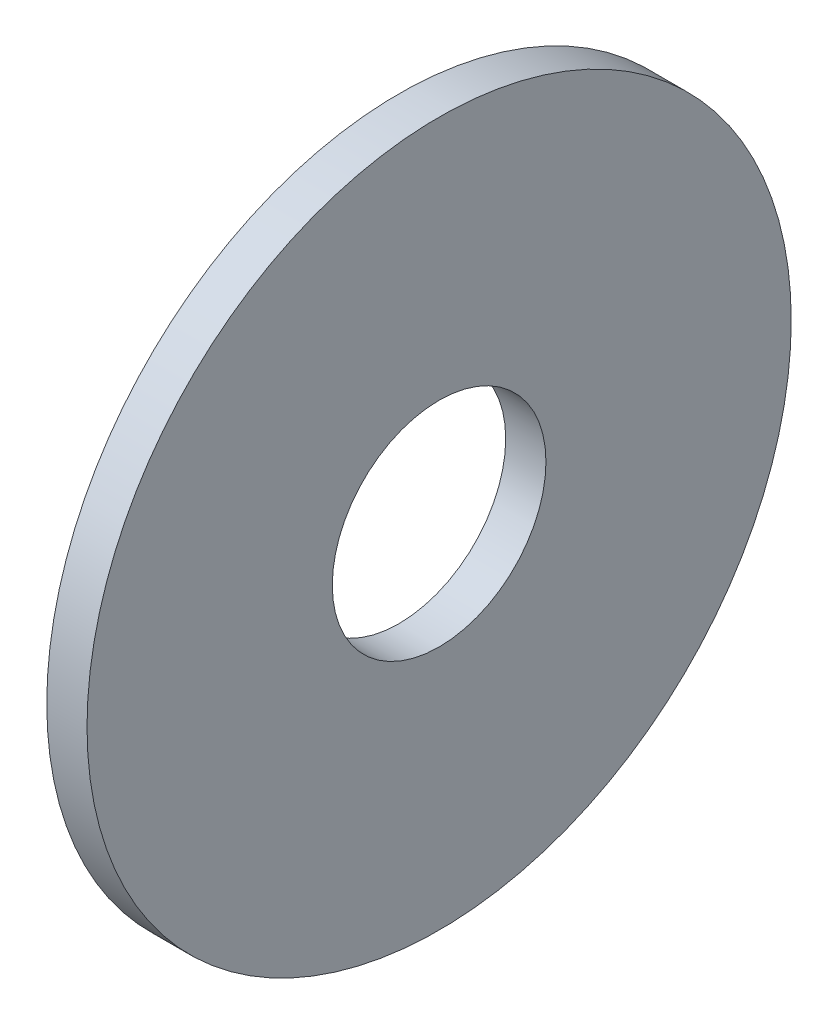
ISO-10303-21;
HEADER;
FILE_DESCRIPTION(('STEP AP214'),'2;1');
FILE_NAME('part.step','',(''),(''),'','','');
FILE_SCHEMA(('AUTOMOTIVE_DESIGN { 1 0 10303 214 1 1 1 1 }'));
ENDSEC;
DATA;
#1=APPLICATION_CONTEXT('core data for automotive mechanical design processes');
#2=APPLICATION_PROTOCOL_DEFINITION('international standard','automotive_design',2000,#1);
#3=PRODUCT_CONTEXT('',#1,'mechanical');
#4=PRODUCT('Part','Part','',(#3));
#5=PRODUCT_RELATED_PRODUCT_CATEGORY('part','',(#4));
#6=PRODUCT_DEFINITION_FORMATION('','',#4);
#7=PRODUCT_DEFINITION_CONTEXT('part definition',#1,'design');
#8=PRODUCT_DEFINITION('design','',#6,#7);
#9=PRODUCT_DEFINITION_SHAPE('','',#8);
#10=(LENGTH_UNIT() NAMED_UNIT(*) SI_UNIT(.MILLI.,.METRE.));
#11=(NAMED_UNIT(*) PLANE_ANGLE_UNIT() SI_UNIT($,.RADIAN.));
#12=(NAMED_UNIT(*) SI_UNIT($,.STERADIAN.) SOLID_ANGLE_UNIT());
#13=UNCERTAINTY_MEASURE_WITH_UNIT(LENGTH_MEASURE(1.E-05),#10,'distance_accuracy_value','');
#14=(GEOMETRIC_REPRESENTATION_CONTEXT(3) GLOBAL_UNCERTAINTY_ASSIGNED_CONTEXT((#13)) GLOBAL_UNIT_ASSIGNED_CONTEXT((#10,
#11,#12)) REPRESENTATION_CONTEXT('',''));
#15=CARTESIAN_POINT('',(0.,0.,0.));
#16=DIRECTION('',(0.,0.,1.));
#17=DIRECTION('',(1.,0.,0.));
#18=AXIS2_PLACEMENT_3D('',#15,#16,#17);
#19=CARTESIAN_POINT('',(-34.9249999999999,0.,0.));
#20=DIRECTION('',(-1.,0.,0.));
#21=DIRECTION('',(0.,0.,1.));
#22=AXIS2_PLACEMENT_3D('',#19,#20,#21);
#23=CYLINDRICAL_SURFACE('',#22,6.7437);
#24=CARTESIAN_POINT('',(0.,0.,0.));
#25=DIRECTION('',(-1.,0.,0.));
#26=DIRECTION('',(0.,0.,1.));
#27=AXIS2_PLACEMENT_3D('',#24,#25,#26);
#28=CIRCLE('',#27,6.7437);
#29=CARTESIAN_POINT('',(0.,0.,6.7437));
#30=VERTEX_POINT('',#29);
#31=EDGE_CURVE('E10',#30,#30,#28,.T.);
#32=ORIENTED_EDGE('',*,*,#31,.F.);
#33=EDGE_LOOP('',(#32));
#34=FACE_BOUND('',#33,.T.);
#35=CARTESIAN_POINT('',(-2.54,0.,0.));
#36=DIRECTION('',(-1.,0.,0.));
#37=DIRECTION('',(0.,0.,1.));
#38=AXIS2_PLACEMENT_3D('',#35,#36,#37);
#39=CIRCLE('',#38,6.7437);
#40=CARTESIAN_POINT('',(-2.54,0.,6.7437));
#41=VERTEX_POINT('',#40);
#42=EDGE_CURVE('E42',#41,#41,#39,.T.);
#43=ORIENTED_EDGE('',*,*,#42,.T.);
#44=EDGE_LOOP('',(#43));
#45=FACE_BOUND('',#44,.T.);
#46=ADVANCED_FACE('F28',(#34,#45),#23,.F.);
#47=CARTESIAN_POINT('',(0.,6.7437,0.));
#48=DIRECTION('',(-1.,0.,0.));
#49=DIRECTION('',(0.,0.,1.));
#50=AXIS2_PLACEMENT_3D('',#47,#48,#49);
#51=PLANE('',#50);
#52=CARTESIAN_POINT('',(0.,0.,0.));
#53=DIRECTION('',(-1.,0.,0.));
#54=DIRECTION('',(0.,0.,1.));
#55=AXIS2_PLACEMENT_3D('',#52,#53,#54);
#56=CIRCLE('',#55,22.225);
#57=CARTESIAN_POINT('',(0.,0.,22.225));
#58=VERTEX_POINT('',#57);
#59=EDGE_CURVE('E34',#58,#58,#56,.T.);
#60=ORIENTED_EDGE('',*,*,#59,.F.);
#61=EDGE_LOOP('',(#60));
#62=FACE_BOUND('',#61,.T.);
#63=ORIENTED_EDGE('',*,*,#31,.T.);
#64=EDGE_LOOP('',(#63));
#65=FACE_BOUND('',#64,.T.);
#66=ADVANCED_FACE('F57',(#62,#65),#51,.F.);
#67=CARTESIAN_POINT('',(-34.9249999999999,0.,0.));
#68=DIRECTION('',(-1.,0.,0.));
#69=DIRECTION('',(0.,0.,1.));
#70=AXIS2_PLACEMENT_3D('',#67,#68,#69);
#71=CYLINDRICAL_SURFACE('',#70,22.225);
#72=CARTESIAN_POINT('',(-2.54,0.,0.));
#73=DIRECTION('',(-1.,0.,0.));
#74=DIRECTION('',(0.,0.,1.));
#75=AXIS2_PLACEMENT_3D('',#72,#73,#74);
#76=CIRCLE('',#75,22.225);
#77=CARTESIAN_POINT('',(-2.54,0.,22.225));
#78=VERTEX_POINT('',#77);
#79=EDGE_CURVE('E38',#78,#78,#76,.T.);
#80=ORIENTED_EDGE('',*,*,#79,.F.);
#81=EDGE_LOOP('',(#80));
#82=FACE_BOUND('',#81,.T.);
#83=ORIENTED_EDGE('',*,*,#59,.T.);
#84=EDGE_LOOP('',(#83));
#85=FACE_BOUND('',#84,.T.);
#86=ADVANCED_FACE('F52',(#82,#85),#71,.T.);
#87=CARTESIAN_POINT('',(-2.54,22.225,0.));
#88=DIRECTION('',(1.,0.,0.));
#89=DIRECTION('',(0.,0.,-1.));
#90=AXIS2_PLACEMENT_3D('',#87,#88,#89);
#91=PLANE('',#90);
#92=ORIENTED_EDGE('',*,*,#42,.F.);
#93=EDGE_LOOP('',(#92));
#94=FACE_BOUND('',#93,.T.);
#95=ORIENTED_EDGE('',*,*,#79,.T.);
#96=EDGE_LOOP('',(#95));
#97=FACE_BOUND('',#96,.T.);
#98=ADVANCED_FACE('F49',(#94,#97),#91,.F.);
#99=CLOSED_SHELL('',(#46,#66,#86,#98));
#100=MANIFOLD_SOLID_BREP('B2',#99);
#101=ADVANCED_BREP_SHAPE_REPRESENTATION('',(#18,#100),#14);
#102=SHAPE_DEFINITION_REPRESENTATION(#9,#101);
ENDSEC;
END-ISO-10303-21;
